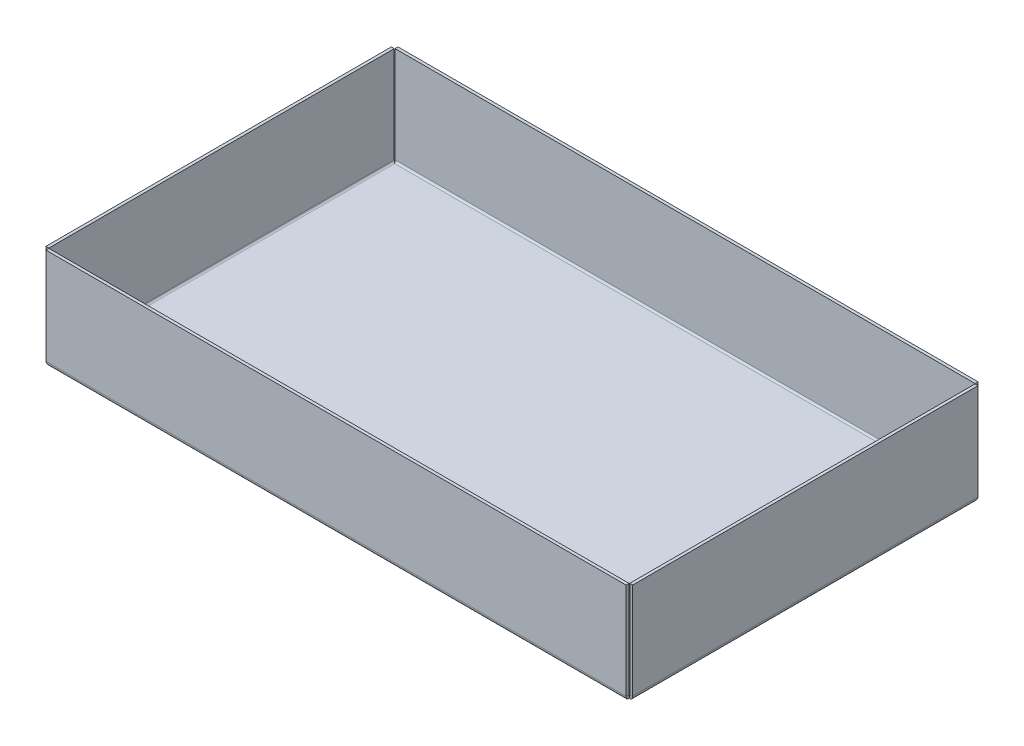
ISO-10303-21;
HEADER;
FILE_DESCRIPTION(('STEP AP214'),'2;1');
FILE_NAME('part.step','',(''),(''),'','','');
FILE_SCHEMA(('AUTOMOTIVE_DESIGN { 1 0 10303 214 1 1 1 1 }'));
ENDSEC;
DATA;
#1=APPLICATION_CONTEXT('core data for automotive mechanical design processes');
#2=APPLICATION_PROTOCOL_DEFINITION('international standard','automotive_design',2000,#1);
#3=PRODUCT_CONTEXT('',#1,'mechanical');
#4=PRODUCT('Part','Part','',(#3));
#5=PRODUCT_RELATED_PRODUCT_CATEGORY('part','',(#4));
#6=PRODUCT_DEFINITION_FORMATION('','',#4);
#7=PRODUCT_DEFINITION_CONTEXT('part definition',#1,'design');
#8=PRODUCT_DEFINITION('design','',#6,#7);
#9=PRODUCT_DEFINITION_SHAPE('','',#8);
#10=(LENGTH_UNIT() NAMED_UNIT(*) SI_UNIT(.MILLI.,.METRE.));
#11=(NAMED_UNIT(*) PLANE_ANGLE_UNIT() SI_UNIT($,.RADIAN.));
#12=(NAMED_UNIT(*) SI_UNIT($,.STERADIAN.) SOLID_ANGLE_UNIT());
#13=UNCERTAINTY_MEASURE_WITH_UNIT(LENGTH_MEASURE(1.E-05),#10,'distance_accuracy_value','');
#14=(GEOMETRIC_REPRESENTATION_CONTEXT(3) GLOBAL_UNCERTAINTY_ASSIGNED_CONTEXT((#13)) GLOBAL_UNIT_ASSIGNED_CONTEXT((#10,
#11,#12)) REPRESENTATION_CONTEXT('',''));
#15=CARTESIAN_POINT('',(0.,0.,0.));
#16=DIRECTION('',(0.,0.,1.));
#17=DIRECTION('',(1.,0.,0.));
#18=AXIS2_PLACEMENT_3D('',#15,#16,#17);
#19=CARTESIAN_POINT('',(-62.996335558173,0.,104.792769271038));
#20=DIRECTION('',(0.,1.,0.));
#21=DIRECTION('',(0.,0.,1.));
#22=AXIS2_PLACEMENT_3D('',#19,#20,#21);
#23=PLANE('',#22);
#24=DIRECTION('',(1.,0.,0.));
#25=VECTOR('',#24,1.);
#26=CARTESIAN_POINT('',(-62.996335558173,0.,-45.5752307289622));
#27=LINE('',#26,#25);
#28=CARTESIAN_POINT('',(-60.964335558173,0.,-45.5752307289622));
#29=VERTEX_POINT('',#28);
#30=CARTESIAN_POINT('',(188.971664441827,0.,-45.5752307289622));
#31=VERTEX_POINT('',#30);
#32=EDGE_CURVE('E52',#29,#31,#27,.T.);
#33=ORIENTED_EDGE('',*,*,#32,.T.);
#34=DIRECTION('',(0.,0.,1.));
#35=VECTOR('',#34,1.);
#36=CARTESIAN_POINT('',(188.971664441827,0.,-47.6072307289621));
#37=LINE('',#36,#35);
#38=CARTESIAN_POINT('',(188.971664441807,0.,102.760769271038));
#39=VERTEX_POINT('',#38);
#40=EDGE_CURVE('E207',#31,#39,#37,.T.);
#41=ORIENTED_EDGE('',*,*,#40,.T.);
#42=DIRECTION('',(-1.,0.,0.));
#43=VECTOR('',#42,1.);
#44=CARTESIAN_POINT('',(1461.00366444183,0.,102.760769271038));
#45=LINE('',#44,#43);
#46=CARTESIAN_POINT('',(-60.9643355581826,0.,102.760769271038));
#47=VERTEX_POINT('',#46);
#48=EDGE_CURVE('E319',#39,#47,#45,.T.);
#49=ORIENTED_EDGE('',*,*,#48,.T.);
#50=DIRECTION('',(0.,0.,-1.));
#51=VECTOR('',#50,1.);
#52=CARTESIAN_POINT('',(-60.964335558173,0.,104.792769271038));
#53=LINE('',#52,#51);
#54=EDGE_CURVE('E324',#47,#29,#53,.T.);
#55=ORIENTED_EDGE('',*,*,#54,.T.);
#56=EDGE_LOOP('',(#33,#41,#49,#55));
#57=FACE_BOUND('',#56,.T.);
#58=ADVANCED_FACE('F28',(#57),#23,.F.);
#59=CARTESIAN_POINT('',(-62.996335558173,1.27,104.792769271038));
#60=DIRECTION('',(0.,1.,0.));
#61=DIRECTION('',(0.,0.,1.));
#62=AXIS2_PLACEMENT_3D('',#59,#60,#61);
#63=PLANE('',#62);
#64=DIRECTION('',(0.,0.,1.));
#65=VECTOR('',#64,1.);
#66=CARTESIAN_POINT('',(188.971664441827,1.27,-47.6072307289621));
#67=LINE('',#66,#65);
#68=CARTESIAN_POINT('',(188.971664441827,1.27,-45.5752307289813));
#69=VERTEX_POINT('',#68);
#70=CARTESIAN_POINT('',(188.971664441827,1.27,102.760769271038));
#71=VERTEX_POINT('',#70);
#72=EDGE_CURVE('E191',#69,#71,#67,.T.);
#73=ORIENTED_EDGE('',*,*,#72,.F.);
#74=DIRECTION('',(1.,0.,0.));
#75=VECTOR('',#74,1.);
#76=CARTESIAN_POINT('',(-62.996335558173,1.27,-45.5752307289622));
#77=LINE('',#76,#75);
#78=CARTESIAN_POINT('',(-60.9643355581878,1.27,-45.5752307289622));
#79=VERTEX_POINT('',#78);
#80=EDGE_CURVE('E237',#79,#69,#77,.T.);
#81=ORIENTED_EDGE('',*,*,#80,.F.);
#82=DIRECTION('',(0.,0.,-1.));
#83=VECTOR('',#82,1.);
#84=CARTESIAN_POINT('',(-60.964335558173,1.27,104.792769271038));
#85=LINE('',#84,#83);
#86=CARTESIAN_POINT('',(-60.964335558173,1.27,102.760769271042));
#87=VERTEX_POINT('',#86);
#88=EDGE_CURVE('E288',#87,#79,#85,.T.);
#89=ORIENTED_EDGE('',*,*,#88,.F.);
#90=DIRECTION('',(-1.,0.,0.));
#91=VECTOR('',#90,1.);
#92=CARTESIAN_POINT('',(1461.00366444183,1.27,102.760769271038));
#93=LINE('',#92,#91);
#94=EDGE_CURVE('E345',#71,#87,#93,.T.);
#95=ORIENTED_EDGE('',*,*,#94,.F.);
#96=EDGE_LOOP('',(#73,#81,#89,#95));
#97=FACE_BOUND('',#96,.T.);
#98=ADVANCED_FACE('F30',(#97),#63,.T.);
#99=CARTESIAN_POINT('',(1461.00366444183,43.709903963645,104.792769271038));
#100=DIRECTION('',(0.,-1.,0.));
#101=DIRECTION('',(-1.,0.,0.));
#102=AXIS2_PLACEMENT_3D('',#99,#100,#101);
#103=PLANE('',#102);
#104=DIRECTION('',(0.,0.,-1.));
#105=VECTOR('',#104,1.);
#106=CARTESIAN_POINT('',(-61.5467304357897,43.709903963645,104.792769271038));
#107=LINE('',#106,#105);
#108=CARTESIAN_POINT('',(-61.5467304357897,43.709903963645,104.792769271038));
#109=VERTEX_POINT('',#108);
#110=CARTESIAN_POINT('',(-61.5467304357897,43.709903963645,103.522769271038));
#111=VERTEX_POINT('',#110);
#112=EDGE_CURVE('E11',#109,#111,#107,.T.);
#113=ORIENTED_EDGE('',*,*,#112,.F.);
#114=DIRECTION('',(-1.,0.,0.));
#115=VECTOR('',#114,1.);
#116=CARTESIAN_POINT('',(1461.00366444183,43.709903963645,104.792769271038));
#117=LINE('',#116,#115);
#118=CARTESIAN_POINT('',(189.554059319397,43.709903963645,104.792769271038));
#119=VERTEX_POINT('',#118);
#120=EDGE_CURVE('E353',#119,#109,#117,.T.);
#121=ORIENTED_EDGE('',*,*,#120,.F.);
#122=DIRECTION('',(0.,0.,-1.));
#123=VECTOR('',#122,1.);
#124=CARTESIAN_POINT('',(189.554059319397,43.709903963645,104.792769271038));
#125=LINE('',#124,#123);
#126=CARTESIAN_POINT('',(189.554059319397,43.709903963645,103.522769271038));
#127=VERTEX_POINT('',#126);
#128=EDGE_CURVE('E37',#119,#127,#125,.T.);
#129=ORIENTED_EDGE('',*,*,#128,.T.);
#130=DIRECTION('',(-1.,0.,0.));
#131=VECTOR('',#130,1.);
#132=CARTESIAN_POINT('',(1461.00366444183,43.709903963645,103.522769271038));
#133=LINE('',#132,#131);
#134=EDGE_CURVE('E367',#127,#111,#133,.T.);
#135=ORIENTED_EDGE('',*,*,#134,.T.);
#136=EDGE_LOOP('',(#113,#121,#129,#135));
#137=FACE_BOUND('',#136,.T.);
#138=ADVANCED_FACE('F383',(#137),#103,.F.);
#139=CARTESIAN_POINT('',(189.554059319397,43.709903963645,104.792769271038));
#140=DIRECTION('',(-1.,0.,0.));
#141=DIRECTION('',(0.,1.,0.));
#142=AXIS2_PLACEMENT_3D('',#139,#140,#141);
#143=PLANE('',#142);
#144=ORIENTED_EDGE('',*,*,#128,.F.);
#145=DIRECTION('',(0.,1.,0.));
#146=VECTOR('',#145,1.);
#147=CARTESIAN_POINT('',(189.554059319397,43.709903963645,104.792769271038));
#148=LINE('',#147,#146);
#149=CARTESIAN_POINT('',(189.554059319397,2.032,104.792769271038));
#150=VERTEX_POINT('',#149);
#151=EDGE_CURVE('E359',#119,#150,#148,.F.);
#152=ORIENTED_EDGE('',*,*,#151,.T.);
#153=DIRECTION('',(0.,0.,-1.));
#154=VECTOR('',#153,1.);
#155=CARTESIAN_POINT('',(189.554059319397,2.032,104.792769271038));
#156=LINE('',#155,#154);
#157=CARTESIAN_POINT('',(189.554059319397,2.032,103.522769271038));
#158=VERTEX_POINT('',#157);
#159=EDGE_CURVE('E378',#150,#158,#156,.T.);
#160=ORIENTED_EDGE('',*,*,#159,.T.);
#161=DIRECTION('',(0.,1.,0.));
#162=VECTOR('',#161,1.);
#163=CARTESIAN_POINT('',(189.554059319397,43.709903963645,103.522769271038));
#164=LINE('',#163,#162);
#165=EDGE_CURVE('E370',#127,#158,#164,.F.);
#166=ORIENTED_EDGE('',*,*,#165,.F.);
#167=EDGE_LOOP('',(#144,#152,#160,#166));
#168=FACE_BOUND('',#167,.T.);
#169=ADVANCED_FACE('F390',(#168),#143,.F.);
#170=CARTESIAN_POINT('',(-61.5467304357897,43.709903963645,104.792769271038));
#171=DIRECTION('',(-1.,0.,0.));
#172=DIRECTION('',(0.,1.,0.));
#173=AXIS2_PLACEMENT_3D('',#170,#171,#172);
#174=PLANE('',#173);
#175=DIRECTION('',(0.,1.,0.));
#176=VECTOR('',#175,1.);
#177=CARTESIAN_POINT('',(-61.5467304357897,43.709903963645,104.792769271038));
#178=LINE('',#177,#176);
#179=CARTESIAN_POINT('',(-61.5467304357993,2.032,104.792769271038));
#180=VERTEX_POINT('',#179);
#181=EDGE_CURVE('E362',#180,#109,#178,.T.);
#182=ORIENTED_EDGE('',*,*,#181,.T.);
#183=ORIENTED_EDGE('',*,*,#112,.T.);
#184=DIRECTION('',(0.,1.,0.));
#185=VECTOR('',#184,1.);
#186=CARTESIAN_POINT('',(-61.5467304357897,43.709903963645,103.522769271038));
#187=LINE('',#186,#185);
#188=CARTESIAN_POINT('',(-61.5467304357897,2.032,103.522769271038));
#189=VERTEX_POINT('',#188);
#190=EDGE_CURVE('E373',#189,#111,#187,.T.);
#191=ORIENTED_EDGE('',*,*,#190,.F.);
#192=DIRECTION('',(0.,0.,-1.));
#193=VECTOR('',#192,1.);
#194=CARTESIAN_POINT('',(-61.5467304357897,2.032,104.792769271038));
#195=LINE('',#194,#193);
#196=EDGE_CURVE('E32',#180,#189,#195,.T.);
#197=ORIENTED_EDGE('',*,*,#196,.F.);
#198=EDGE_LOOP('',(#182,#183,#191,#197));
#199=FACE_BOUND('',#198,.T.);
#200=ADVANCED_FACE('F447',(#199),#174,.T.);
#201=CARTESIAN_POINT('',(1461.00366444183,43.709903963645,103.522769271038));
#202=DIRECTION('',(0.,0.,-1.));
#203=DIRECTION('',(-1.,0.,0.));
#204=AXIS2_PLACEMENT_3D('',#201,#202,#203);
#205=PLANE('',#204);
#206=DIRECTION('',(-1.,0.,0.));
#207=VECTOR('',#206,1.);
#208=CARTESIAN_POINT('',(1461.00366444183,2.032,103.522769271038));
#209=LINE('',#208,#207);
#210=EDGE_CURVE('E368',#158,#189,#209,.T.);
#211=ORIENTED_EDGE('',*,*,#210,.T.);
#212=ORIENTED_EDGE('',*,*,#190,.T.);
#213=ORIENTED_EDGE('',*,*,#134,.F.);
#214=ORIENTED_EDGE('',*,*,#165,.T.);
#215=EDGE_LOOP('',(#211,#212,#213,#214));
#216=FACE_BOUND('',#215,.T.);
#217=ADVANCED_FACE('F388',(#216),#205,.T.);
#218=CARTESIAN_POINT('',(1461.00366444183,43.709903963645,104.792769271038));
#219=DIRECTION('',(0.,0.,-1.));
#220=DIRECTION('',(-1.,0.,0.));
#221=AXIS2_PLACEMENT_3D('',#218,#219,#220);
#222=PLANE('',#221);
#223=DIRECTION('',(-1.,0.,0.));
#224=VECTOR('',#223,1.);
#225=CARTESIAN_POINT('',(1461.00366444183,2.032,104.792769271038));
#226=LINE('',#225,#224);
#227=EDGE_CURVE('E356',#150,#180,#226,.T.);
#228=ORIENTED_EDGE('',*,*,#227,.F.);
#229=ORIENTED_EDGE('',*,*,#151,.F.);
#230=ORIENTED_EDGE('',*,*,#120,.T.);
#231=ORIENTED_EDGE('',*,*,#181,.F.);
#232=EDGE_LOOP('',(#228,#229,#230,#231));
#233=FACE_BOUND('',#232,.T.);
#234=ADVANCED_FACE('F451',(#233),#222,.F.);
#235=CARTESIAN_POINT('',(188.389269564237,2.032,101.998769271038));
#236=CARTESIAN_POINT('',(188.389269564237,2.032,101.575435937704));
#237=CARTESIAN_POINT('',(188.389269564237,2.032,101.152102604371));
#238=CARTESIAN_POINT('',(188.389269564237,2.032,100.728769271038));
#239=CARTESIAN_POINT('',(188.389269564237,3.556,101.998769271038));
#240=CARTESIAN_POINT('',(188.389269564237,4.40266666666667,101.575435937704));
#241=CARTESIAN_POINT('',(188.389269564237,5.24933333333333,101.152102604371));
#242=CARTESIAN_POINT('',(188.389269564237,6.096,100.728769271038));
#243=CARTESIAN_POINT('',(189.554059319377,3.556,103.522769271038));
#244=CARTESIAN_POINT('',(189.554059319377,4.40266666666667,103.946102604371));
#245=CARTESIAN_POINT('',(189.554059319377,5.24933333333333,104.369435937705));
#246=CARTESIAN_POINT('',(189.554059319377,6.096,104.792769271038));
#247=CARTESIAN_POINT('',(189.554059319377,2.032,103.522769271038));
#248=CARTESIAN_POINT('',(189.554059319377,2.032,103.946102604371));
#249=CARTESIAN_POINT('',(189.554059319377,2.032,104.369435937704));
#250=CARTESIAN_POINT('',(189.554059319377,2.032,104.792769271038));
#251=CARTESIAN_POINT('',(189.554059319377,0.507999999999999,103.522769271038));
#252=CARTESIAN_POINT('',(189.554059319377,-0.338666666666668,103.946102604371));
#253=CARTESIAN_POINT('',(189.554059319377,-1.18533333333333,104.369435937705));
#254=CARTESIAN_POINT('',(189.554059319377,-2.032,104.792769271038));
#255=CARTESIAN_POINT('',(188.389269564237,0.507999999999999,101.998769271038));
#256=CARTESIAN_POINT('',(188.389269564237,-0.338666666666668,101.575435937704));
#257=CARTESIAN_POINT('',(188.389269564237,-1.18533333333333,101.152102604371));
#258=CARTESIAN_POINT('',(188.389269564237,-2.032,100.728769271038));
#259=CARTESIAN_POINT('',(188.389269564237,2.032,101.998769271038));
#260=CARTESIAN_POINT('',(188.389269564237,2.032,101.575435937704));
#261=CARTESIAN_POINT('',(188.389269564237,2.032,101.152102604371));
#262=CARTESIAN_POINT('',(188.389269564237,2.032,100.728769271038));
#263=(BOUNDED_SURFACE() B_SPLINE_SURFACE(3,3,((#235,#236,#237,#238),(#239,#240,#241,#242),(#243,
#244,#245,#246),(#247,#248,#249,#250),(#251,#252,#253,#254),(#255,#256,#257,#258),(#259,#260,
#261,#262)),.UNSPECIFIED.,.T.,.F.,.F.) B_SPLINE_SURFACE_WITH_KNOTS((4,3,4),(4,4),(0.,0.5,1.),
(0.,1.),.UNSPECIFIED.) GEOMETRIC_REPRESENTATION_ITEM() RATIONAL_B_SPLINE_SURFACE(((1.,1.,1.,1.),
(0.333333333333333,0.333333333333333,0.333333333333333,0.333333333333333),(0.333333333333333,
0.333333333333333,0.333333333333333,0.333333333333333),(1.,1.,1.,1.),(0.333333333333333,
0.333333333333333,0.333333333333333,0.333333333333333),(0.333333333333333,0.333333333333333,
0.333333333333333,0.333333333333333),(1.,1.,1.,1.))) REPRESENTATION_ITEM('') SURFACE());
#264=CARTESIAN_POINT('',(188.971664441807,2.032,102.760769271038));
#265=DIRECTION('',(0.961295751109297,0.,-0.275518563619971));
#266=DIRECTION('',(-0.275518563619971,0.,-0.961295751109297));
#267=AXIS2_PLACEMENT_3D('',#264,#265,#266);
#268=ELLIPSE('',#267,2.11381356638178,2.032);
#269=EDGE_CURVE('E339',#150,#39,#268,.T.);
#270=DIRECTION('',(0.,1.,0.));
#271=VECTOR('',#270,1.);
#272=CARTESIAN_POINT('',(188.971664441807,0.,102.760769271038));
#273=LINE('',#272,#271);
#274=EDGE_CURVE('E206',#39,#71,#273,.T.);
#275=CARTESIAN_POINT('',(188.971664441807,2.032,102.760769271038));
#276=DIRECTION('',(0.794514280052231,0.,-0.607245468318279));
#277=DIRECTION('',(-0.607245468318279,0.,-0.794514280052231));
#278=AXIS2_PLACEMENT_3D('',#275,#276,#277);
#279=ELLIPSE('',#278,0.959076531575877,0.762);
#280=EDGE_CURVE('E44',#158,#71,#279,.T.);
#281=ORIENTED_EDGE('',*,*,#159,.F.);
#282=ORIENTED_EDGE('',*,*,#269,.T.);
#283=ORIENTED_EDGE('',*,*,#274,.T.);
#284=ORIENTED_EDGE('',*,*,#280,.F.);
#285=EDGE_LOOP('',(#281,#282,#283,#284));
#286=FACE_BOUND('',#285,.T.);
#287=ADVANCED_FACE('F394',(#286),#263,.F.);
#288=CARTESIAN_POINT('',(-61.5467304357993,2.032,103.522769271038));
#289=CARTESIAN_POINT('',(-61.5467304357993,2.032,103.946102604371));
#290=CARTESIAN_POINT('',(-61.5467304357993,2.032,104.369435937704));
#291=CARTESIAN_POINT('',(-61.5467304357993,2.032,104.792769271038));
#292=CARTESIAN_POINT('',(-61.5467304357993,3.556,103.522769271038));
#293=CARTESIAN_POINT('',(-61.5467304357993,4.40266666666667,103.946102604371));
#294=CARTESIAN_POINT('',(-61.5467304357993,5.24933333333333,104.369435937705));
#295=CARTESIAN_POINT('',(-61.5467304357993,6.096,104.792769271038));
#296=CARTESIAN_POINT('',(-60.3819406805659,3.556,101.998769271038));
#297=CARTESIAN_POINT('',(-60.3819406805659,4.40266666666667,101.575435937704));
#298=CARTESIAN_POINT('',(-60.3819406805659,5.24933333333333,101.152102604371));
#299=CARTESIAN_POINT('',(-60.3819406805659,6.096,100.728769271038));
#300=CARTESIAN_POINT('',(-60.3819406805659,2.032,101.998769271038));
#301=CARTESIAN_POINT('',(-60.3819406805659,2.032,101.575435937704));
#302=CARTESIAN_POINT('',(-60.3819406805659,2.032,101.152102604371));
#303=CARTESIAN_POINT('',(-60.3819406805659,2.032,100.728769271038));
#304=CARTESIAN_POINT('',(-60.3819406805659,0.508,101.998769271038));
#305=CARTESIAN_POINT('',(-60.3819406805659,-0.338666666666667,101.575435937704));
#306=CARTESIAN_POINT('',(-60.3819406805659,-1.18533333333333,101.152102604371));
#307=CARTESIAN_POINT('',(-60.3819406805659,-2.032,100.728769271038));
#308=CARTESIAN_POINT('',(-61.5467304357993,0.508,103.522769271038));
#309=CARTESIAN_POINT('',(-61.5467304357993,-0.338666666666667,103.946102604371));
#310=CARTESIAN_POINT('',(-61.5467304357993,-1.18533333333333,104.369435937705));
#311=CARTESIAN_POINT('',(-61.5467304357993,-2.032,104.792769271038));
#312=CARTESIAN_POINT('',(-61.5467304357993,2.032,103.522769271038));
#313=CARTESIAN_POINT('',(-61.5467304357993,2.032,103.946102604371));
#314=CARTESIAN_POINT('',(-61.5467304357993,2.032,104.369435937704));
#315=CARTESIAN_POINT('',(-61.5467304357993,2.032,104.792769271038));
#316=(BOUNDED_SURFACE() B_SPLINE_SURFACE(3,3,((#288,#289,#290,#291),(#292,#293,#294,#295),(#296,
#297,#298,#299),(#300,#301,#302,#303),(#304,#305,#306,#307),(#308,#309,#310,#311),(#312,#313,
#314,#315)),.UNSPECIFIED.,.T.,.F.,.F.) B_SPLINE_SURFACE_WITH_KNOTS((4,3,4),(4,4),(0.,0.5,1.),
(0.,1.),.UNSPECIFIED.) GEOMETRIC_REPRESENTATION_ITEM() RATIONAL_B_SPLINE_SURFACE(((1.,1.,1.,1.),
(0.333333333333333,0.333333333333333,0.333333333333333,0.333333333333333),(0.333333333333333,
0.333333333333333,0.333333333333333,0.333333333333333),(1.,1.,1.,1.),(0.333333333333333,
0.333333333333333,0.333333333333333,0.333333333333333),(0.333333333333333,0.333333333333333,
0.333333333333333,0.333333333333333),(1.,1.,1.,1.))) REPRESENTATION_ITEM('') SURFACE());
#317=CARTESIAN_POINT('',(-60.9643355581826,2.032,102.760769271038));
#318=DIRECTION('',(-0.961295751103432,0.,-0.275518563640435));
#319=DIRECTION('',(-0.275518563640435,0.,0.961295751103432));
#320=AXIS2_PLACEMENT_3D('',#317,#318,#319);
#321=ELLIPSE('',#320,2.11381356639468,2.032);
#322=EDGE_CURVE('E342',#47,#180,#321,.T.);
#323=CARTESIAN_POINT('',(-60.9643355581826,2.032,102.760769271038));
#324=DIRECTION('',(-0.794514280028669,0.,-0.607245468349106));
#325=DIRECTION('',(-0.607245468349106,0.,0.794514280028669));
#326=AXIS2_PLACEMENT_3D('',#323,#324,#325);
#327=ELLIPSE('',#326,0.959076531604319,0.762);
#328=EDGE_CURVE('E348',#87,#189,#327,.T.);
#329=DIRECTION('',(0.,1.,0.));
#330=VECTOR('',#329,1.);
#331=CARTESIAN_POINT('',(-60.9643355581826,0.,102.760769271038));
#332=LINE('',#331,#330);
#333=EDGE_CURVE('E351',#47,#87,#332,.T.);
#334=ORIENTED_EDGE('',*,*,#322,.T.);
#335=ORIENTED_EDGE('',*,*,#196,.T.);
#336=ORIENTED_EDGE('',*,*,#328,.F.);
#337=ORIENTED_EDGE('',*,*,#333,.F.);
#338=EDGE_LOOP('',(#334,#335,#336,#337));
#339=FACE_BOUND('',#338,.T.);
#340=ADVANCED_FACE('F439',(#339),#316,.F.);
#341=CARTESIAN_POINT('',(1461.00366444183,2.032,102.760769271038));
#342=DIRECTION('',(-1.,0.,0.));
#343=DIRECTION('',(0.,0.,1.));
#344=AXIS2_PLACEMENT_3D('',#341,#342,#343);
#345=CYLINDRICAL_SURFACE('',#344,0.762);
#346=ORIENTED_EDGE('',*,*,#94,.T.);
#347=ORIENTED_EDGE('',*,*,#328,.T.);
#348=ORIENTED_EDGE('',*,*,#210,.F.);
#349=ORIENTED_EDGE('',*,*,#280,.T.);
#350=EDGE_LOOP('',(#346,#347,#348,#349));
#351=FACE_BOUND('',#350,.T.);
#352=ADVANCED_FACE('F437',(#351),#345,.F.);
#353=CARTESIAN_POINT('',(1461.00366444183,2.032,102.760769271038));
#354=DIRECTION('',(-1.,0.,0.));
#355=DIRECTION('',(0.,0.,1.));
#356=AXIS2_PLACEMENT_3D('',#353,#354,#355);
#357=CYLINDRICAL_SURFACE('',#356,2.032);
#358=ORIENTED_EDGE('',*,*,#48,.F.);
#359=ORIENTED_EDGE('',*,*,#269,.F.);
#360=ORIENTED_EDGE('',*,*,#227,.T.);
#361=ORIENTED_EDGE('',*,*,#322,.F.);
#362=EDGE_LOOP('',(#358,#359,#360,#361));
#363=FACE_BOUND('',#362,.T.);
#364=ADVANCED_FACE('F396',(#363),#357,.T.);
#365=CARTESIAN_POINT('',(-62.996335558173,43.709903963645,1374.79276927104));
#366=DIRECTION('',(0.,-1.,0.));
#367=DIRECTION('',(0.,0.,-1.));
#368=AXIS2_PLACEMENT_3D('',#365,#366,#367);
#369=PLANE('',#368);
#370=DIRECTION('',(1.,0.,0.));
#371=VECTOR('',#370,1.);
#372=CARTESIAN_POINT('',(-62.9963355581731,43.709903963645,-46.1576256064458));
#373=LINE('',#372,#371);
#374=CARTESIAN_POINT('',(-62.9963355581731,43.709903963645,-46.1576256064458));
#375=VERTEX_POINT('',#374);
#376=CARTESIAN_POINT('',(-61.7263355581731,43.709903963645,-46.1576256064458));
#377=VERTEX_POINT('',#376);
#378=EDGE_CURVE('E290',#375,#377,#373,.T.);
#379=ORIENTED_EDGE('',*,*,#378,.F.);
#380=DIRECTION('',(0.,0.,-1.));
#381=VECTOR('',#380,1.);
#382=CARTESIAN_POINT('',(-62.996335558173,43.709903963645,1374.79276927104));
#383=LINE('',#382,#381);
#384=CARTESIAN_POINT('',(-62.9963355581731,43.709903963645,103.343164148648));
#385=VERTEX_POINT('',#384);
#386=EDGE_CURVE('E307',#385,#375,#383,.T.);
#387=ORIENTED_EDGE('',*,*,#386,.F.);
#388=DIRECTION('',(1.,0.,0.));
#389=VECTOR('',#388,1.);
#390=CARTESIAN_POINT('',(-62.9963355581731,43.709903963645,103.343164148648));
#391=LINE('',#390,#389);
#392=CARTESIAN_POINT('',(-61.7263355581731,43.709903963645,103.343164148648));
#393=VERTEX_POINT('',#392);
#394=EDGE_CURVE('E268',#385,#393,#391,.T.);
#395=ORIENTED_EDGE('',*,*,#394,.T.);
#396=DIRECTION('',(0.,0.,-1.));
#397=VECTOR('',#396,1.);
#398=CARTESIAN_POINT('',(-61.726335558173,43.709903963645,1374.79276927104));
#399=LINE('',#398,#397);
#400=EDGE_CURVE('E295',#393,#377,#399,.T.);
#401=ORIENTED_EDGE('',*,*,#400,.T.);
#402=EDGE_LOOP('',(#379,#387,#395,#401));
#403=FACE_BOUND('',#402,.T.);
#404=ADVANCED_FACE('F429',(#403),#369,.F.);
#405=CARTESIAN_POINT('',(-62.9963355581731,43.709903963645,103.343164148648));
#406=DIRECTION('',(0.,0.,-1.));
#407=DIRECTION('',(0.,1.,0.));
#408=AXIS2_PLACEMENT_3D('',#405,#406,#407);
#409=PLANE('',#408);
#410=ORIENTED_EDGE('',*,*,#394,.F.);
#411=DIRECTION('',(0.,1.,0.));
#412=VECTOR('',#411,1.);
#413=CARTESIAN_POINT('',(-62.9963355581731,43.709903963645,103.343164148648));
#414=LINE('',#413,#412);
#415=CARTESIAN_POINT('',(-62.9963355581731,2.032,103.343164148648));
#416=VERTEX_POINT('',#415);
#417=EDGE_CURVE('E298',#385,#416,#414,.F.);
#418=ORIENTED_EDGE('',*,*,#417,.T.);
#419=DIRECTION('',(1.,0.,0.));
#420=VECTOR('',#419,1.);
#421=CARTESIAN_POINT('',(-62.9963355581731,2.032,103.343164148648));
#422=LINE('',#421,#420);
#423=CARTESIAN_POINT('',(-61.7263355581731,2.032,103.343164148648));
#424=VERTEX_POINT('',#423);
#425=EDGE_CURVE('E296',#416,#424,#422,.T.);
#426=ORIENTED_EDGE('',*,*,#425,.T.);
#427=DIRECTION('',(0.,1.,0.));
#428=VECTOR('',#427,1.);
#429=CARTESIAN_POINT('',(-61.7263355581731,43.709903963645,103.343164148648));
#430=LINE('',#429,#428);
#431=EDGE_CURVE('E302',#393,#424,#430,.F.);
#432=ORIENTED_EDGE('',*,*,#431,.F.);
#433=EDGE_LOOP('',(#410,#418,#426,#432));
#434=FACE_BOUND('',#433,.T.);
#435=ADVANCED_FACE('F410',(#434),#409,.F.);
#436=CARTESIAN_POINT('',(-62.9963355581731,43.709903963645,-46.1576256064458));
#437=DIRECTION('',(0.,0.,-1.));
#438=DIRECTION('',(0.,1.,0.));
#439=AXIS2_PLACEMENT_3D('',#436,#437,#438);
#440=PLANE('',#439);
#441=DIRECTION('',(0.,1.,0.));
#442=VECTOR('',#441,1.);
#443=CARTESIAN_POINT('',(-62.9963355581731,43.709903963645,-46.1576256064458));
#444=LINE('',#443,#442);
#445=CARTESIAN_POINT('',(-62.996335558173,2.032,-46.1576256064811));
#446=VERTEX_POINT('',#445);
#447=EDGE_CURVE('E293',#446,#375,#444,.T.);
#448=ORIENTED_EDGE('',*,*,#447,.T.);
#449=ORIENTED_EDGE('',*,*,#378,.T.);
#450=DIRECTION('',(0.,1.,0.));
#451=VECTOR('',#450,1.);
#452=CARTESIAN_POINT('',(-61.7263355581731,43.709903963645,-46.1576256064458));
#453=LINE('',#452,#451);
#454=CARTESIAN_POINT('',(-61.7263355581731,2.032,-46.1576256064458));
#455=VERTEX_POINT('',#454);
#456=EDGE_CURVE('E299',#455,#377,#453,.T.);
#457=ORIENTED_EDGE('',*,*,#456,.F.);
#458=DIRECTION('',(1.,0.,0.));
#459=VECTOR('',#458,1.);
#460=CARTESIAN_POINT('',(-62.9963355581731,2.032,-46.1576256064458));
#461=LINE('',#460,#459);
#462=EDGE_CURVE('E285',#446,#455,#461,.T.);
#463=ORIENTED_EDGE('',*,*,#462,.F.);
#464=EDGE_LOOP('',(#448,#449,#457,#463));
#465=FACE_BOUND('',#464,.T.);
#466=ADVANCED_FACE('F424',(#465),#440,.T.);
#467=CARTESIAN_POINT('',(-61.726335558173,43.709903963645,1374.79276927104));
#468=DIRECTION('',(1.,0.,0.));
#469=DIRECTION('',(0.,0.,-1.));
#470=AXIS2_PLACEMENT_3D('',#467,#468,#469);
#471=PLANE('',#470);
#472=DIRECTION('',(0.,0.,-1.));
#473=VECTOR('',#472,1.);
#474=CARTESIAN_POINT('',(-61.726335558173,2.032,1374.79276927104));
#475=LINE('',#474,#473);
#476=EDGE_CURVE('E292',#424,#455,#475,.T.);
#477=ORIENTED_EDGE('',*,*,#476,.T.);
#478=ORIENTED_EDGE('',*,*,#456,.T.);
#479=ORIENTED_EDGE('',*,*,#400,.F.);
#480=ORIENTED_EDGE('',*,*,#431,.T.);
#481=EDGE_LOOP('',(#477,#478,#479,#480));
#482=FACE_BOUND('',#481,.T.);
#483=ADVANCED_FACE('F415',(#482),#471,.T.);
#484=CARTESIAN_POINT('',(-62.996335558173,43.709903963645,1374.79276927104));
#485=DIRECTION('',(1.,0.,0.));
#486=DIRECTION('',(0.,0.,-1.));
#487=AXIS2_PLACEMENT_3D('',#484,#485,#486);
#488=PLANE('',#487);
#489=DIRECTION('',(0.,0.,-1.));
#490=VECTOR('',#489,1.);
#491=CARTESIAN_POINT('',(-62.996335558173,2.032,1374.79276927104));
#492=LINE('',#491,#490);
#493=EDGE_CURVE('E316',#416,#446,#492,.T.);
#494=ORIENTED_EDGE('',*,*,#493,.F.);
#495=ORIENTED_EDGE('',*,*,#417,.F.);
#496=ORIENTED_EDGE('',*,*,#386,.T.);
#497=ORIENTED_EDGE('',*,*,#447,.F.);
#498=EDGE_LOOP('',(#494,#495,#496,#497));
#499=FACE_BOUND('',#498,.T.);
#500=ADVANCED_FACE('F426',(#499),#488,.F.);
#501=CARTESIAN_POINT('',(-60.202335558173,2.032,102.178374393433));
#502=CARTESIAN_POINT('',(-59.7790022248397,2.032,102.178374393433));
#503=CARTESIAN_POINT('',(-59.3556688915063,2.032,102.178374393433));
#504=CARTESIAN_POINT('',(-58.932335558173,2.032,102.178374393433));
#505=CARTESIAN_POINT('',(-60.202335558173,3.556,102.178374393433));
#506=CARTESIAN_POINT('',(-59.7790022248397,4.40266666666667,102.178374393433));
#507=CARTESIAN_POINT('',(-59.3556688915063,5.24933333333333,102.178374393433));
#508=CARTESIAN_POINT('',(-58.932335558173,6.096,102.178374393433));
#509=CARTESIAN_POINT('',(-61.726335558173,3.556,103.343164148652));
#510=CARTESIAN_POINT('',(-62.1496688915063,4.40266666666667,103.343164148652));
#511=CARTESIAN_POINT('',(-62.5730022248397,5.24933333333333,103.343164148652));
#512=CARTESIAN_POINT('',(-62.996335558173,6.096,103.343164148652));
#513=CARTESIAN_POINT('',(-61.726335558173,2.032,103.343164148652));
#514=CARTESIAN_POINT('',(-62.1496688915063,2.032,103.343164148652));
#515=CARTESIAN_POINT('',(-62.5730022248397,2.032,103.343164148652));
#516=CARTESIAN_POINT('',(-62.996335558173,2.032,103.343164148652));
#517=CARTESIAN_POINT('',(-61.726335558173,0.508,103.343164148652));
#518=CARTESIAN_POINT('',(-62.1496688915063,-0.338666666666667,103.343164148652));
#519=CARTESIAN_POINT('',(-62.5730022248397,-1.18533333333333,103.343164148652));
#520=CARTESIAN_POINT('',(-62.996335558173,-2.032,103.343164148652));
#521=CARTESIAN_POINT('',(-60.202335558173,0.508,102.178374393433));
#522=CARTESIAN_POINT('',(-59.7790022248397,-0.338666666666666,102.178374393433));
#523=CARTESIAN_POINT('',(-59.3556688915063,-1.18533333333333,102.178374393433));
#524=CARTESIAN_POINT('',(-58.932335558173,-2.032,102.178374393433));
#525=CARTESIAN_POINT('',(-60.202335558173,2.032,102.178374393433));
#526=CARTESIAN_POINT('',(-59.7790022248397,2.032,102.178374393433));
#527=CARTESIAN_POINT('',(-59.3556688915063,2.032,102.178374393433));
#528=CARTESIAN_POINT('',(-58.932335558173,2.032,102.178374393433));
#529=(BOUNDED_SURFACE() B_SPLINE_SURFACE(3,3,((#501,#502,#503,#504),(#505,#506,#507,#508),(#509,
#510,#511,#512),(#513,#514,#515,#516),(#517,#518,#519,#520),(#521,#522,#523,#524),(#525,#526,
#527,#528)),.UNSPECIFIED.,.T.,.F.,.F.) B_SPLINE_SURFACE_WITH_KNOTS((4,3,4),(4,4),(0.,0.5,1.),
(0.,1.),.UNSPECIFIED.) GEOMETRIC_REPRESENTATION_ITEM() RATIONAL_B_SPLINE_SURFACE(((1.,1.,1.,1.),
(0.333333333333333,0.333333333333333,0.333333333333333,0.333333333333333),(0.333333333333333,
0.333333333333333,0.333333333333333,0.333333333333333),(1.,1.,1.,1.),(0.333333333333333,
0.333333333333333,0.333333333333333,0.333333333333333),(0.333333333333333,0.333333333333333,
0.333333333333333,0.333333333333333),(1.,1.,1.,1.))) REPRESENTATION_ITEM('') SURFACE());
#530=CARTESIAN_POINT('',(-60.964335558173,2.032,102.760769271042));
#531=DIRECTION('',(0.275518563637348,0.,0.961295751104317));
#532=DIRECTION('',(0.961295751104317,0.,-0.275518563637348));
#533=AXIS2_PLACEMENT_3D('',#530,#531,#532);
#534=ELLIPSE('',#533,2.11381356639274,2.032);
#535=EDGE_CURVE('E313',#416,#47,#534,.T.);
#536=CARTESIAN_POINT('',(-60.964335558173,2.032,102.760769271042));
#537=DIRECTION('',(0.607245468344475,0.,0.794514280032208));
#538=DIRECTION('',(0.794514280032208,0.,-0.607245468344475));
#539=AXIS2_PLACEMENT_3D('',#536,#537,#538);
#540=ELLIPSE('',#539,0.959076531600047,0.762);
#541=EDGE_CURVE('E320',#424,#87,#540,.T.);
#542=ORIENTED_EDGE('',*,*,#425,.F.);
#543=ORIENTED_EDGE('',*,*,#535,.T.);
#544=ORIENTED_EDGE('',*,*,#333,.T.);
#545=ORIENTED_EDGE('',*,*,#541,.F.);
#546=EDGE_LOOP('',(#542,#543,#544,#545));
#547=FACE_BOUND('',#546,.T.);
#548=ADVANCED_FACE('F406',(#547),#529,.F.);
#549=CARTESIAN_POINT('',(-61.726335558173,2.032,-46.1576256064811));
#550=CARTESIAN_POINT('',(-62.1496688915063,2.032,-46.1576256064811));
#551=CARTESIAN_POINT('',(-62.5730022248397,2.032,-46.1576256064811));
#552=CARTESIAN_POINT('',(-62.996335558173,2.032,-46.1576256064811));
#553=CARTESIAN_POINT('',(-61.726335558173,3.556,-46.1576256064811));
#554=CARTESIAN_POINT('',(-62.1496688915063,4.40266666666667,-46.1576256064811));
#555=CARTESIAN_POINT('',(-62.5730022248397,5.24933333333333,-46.1576256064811));
#556=CARTESIAN_POINT('',(-62.996335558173,6.096,-46.1576256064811));
#557=CARTESIAN_POINT('',(-60.202335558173,3.556,-44.992835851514));
#558=CARTESIAN_POINT('',(-59.7790022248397,4.40266666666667,-44.992835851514));
#559=CARTESIAN_POINT('',(-59.3556688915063,5.24933333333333,-44.992835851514));
#560=CARTESIAN_POINT('',(-58.932335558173,6.096,-44.992835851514));
#561=CARTESIAN_POINT('',(-60.202335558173,2.032,-44.992835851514));
#562=CARTESIAN_POINT('',(-59.7790022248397,2.032,-44.992835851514));
#563=CARTESIAN_POINT('',(-59.3556688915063,2.032,-44.992835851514));
#564=CARTESIAN_POINT('',(-58.932335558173,2.032,-44.992835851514));
#565=CARTESIAN_POINT('',(-60.202335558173,0.508,-44.992835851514));
#566=CARTESIAN_POINT('',(-59.7790022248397,-0.338666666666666,-44.992835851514));
#567=CARTESIAN_POINT('',(-59.3556688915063,-1.18533333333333,-44.992835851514));
#568=CARTESIAN_POINT('',(-58.932335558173,-2.032,-44.992835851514));
#569=CARTESIAN_POINT('',(-61.726335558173,0.507999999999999,-46.1576256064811));
#570=CARTESIAN_POINT('',(-62.1496688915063,-0.338666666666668,-46.1576256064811));
#571=CARTESIAN_POINT('',(-62.5730022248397,-1.18533333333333,-46.1576256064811));
#572=CARTESIAN_POINT('',(-62.996335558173,-2.032,-46.1576256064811));
#573=CARTESIAN_POINT('',(-61.726335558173,2.032,-46.1576256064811));
#574=CARTESIAN_POINT('',(-62.1496688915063,2.032,-46.1576256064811));
#575=CARTESIAN_POINT('',(-62.5730022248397,2.032,-46.1576256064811));
#576=CARTESIAN_POINT('',(-62.996335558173,2.032,-46.1576256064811));
#577=(BOUNDED_SURFACE() B_SPLINE_SURFACE(3,3,((#549,#550,#551,#552),(#553,#554,#555,#556),(#557,
#558,#559,#560),(#561,#562,#563,#564),(#565,#566,#567,#568),(#569,#570,#571,#572),(#573,#574,
#575,#576)),.UNSPECIFIED.,.T.,.F.,.F.) B_SPLINE_SURFACE_WITH_KNOTS((4,3,4),(4,4),(0.,0.5,1.),
(0.,1.),.UNSPECIFIED.) GEOMETRIC_REPRESENTATION_ITEM() RATIONAL_B_SPLINE_SURFACE(((1.,1.,1.,1.),
(0.333333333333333,0.333333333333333,0.333333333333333,0.333333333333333),(0.333333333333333,
0.333333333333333,0.333333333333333,0.333333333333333),(1.,1.,1.,1.),(0.333333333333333,
0.333333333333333,0.333333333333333,0.333333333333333),(0.333333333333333,0.333333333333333,
0.333333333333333,0.333333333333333),(1.,1.,1.,1.))) REPRESENTATION_ITEM('') SURFACE());
#578=CARTESIAN_POINT('',(-60.964335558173,2.032,-45.5752307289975));
#579=DIRECTION('',(0.275518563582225,0.,-0.961295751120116));
#580=DIRECTION('',(-0.961295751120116,0.,-0.275518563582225));
#581=AXIS2_PLACEMENT_3D('',#578,#579,#580);
#582=ELLIPSE('',#581,2.113813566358,2.032);
#583=EDGE_CURVE('E289',#29,#446,#582,.T.);
#584=CARTESIAN_POINT('',(-60.964335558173,2.032,-45.5752307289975));
#585=DIRECTION('',(0.607245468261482,0.,-0.79451428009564));
#586=DIRECTION('',(-0.79451428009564,0.,-0.607245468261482));
#587=AXIS2_PLACEMENT_3D('',#584,#585,#586);
#588=ELLIPSE('',#587,0.959076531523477,0.762);
#589=EDGE_CURVE('E325',#79,#455,#588,.T.);
#590=DIRECTION('',(0.,1.,0.));
#591=VECTOR('',#590,1.);
#592=CARTESIAN_POINT('',(-60.964335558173,0.,-45.5752307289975));
#593=LINE('',#592,#591);
#594=EDGE_CURVE('E321',#29,#79,#593,.T.);
#595=ORIENTED_EDGE('',*,*,#583,.T.);
#596=ORIENTED_EDGE('',*,*,#462,.T.);
#597=ORIENTED_EDGE('',*,*,#589,.F.);
#598=ORIENTED_EDGE('',*,*,#594,.F.);
#599=EDGE_LOOP('',(#595,#596,#597,#598));
#600=FACE_BOUND('',#599,.T.);
#601=ADVANCED_FACE('F421',(#600),#577,.F.);
#602=CARTESIAN_POINT('',(-60.964335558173,2.032,104.792769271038));
#603=DIRECTION('',(0.,0.,-1.));
#604=DIRECTION('',(-1.,0.,0.));
#605=AXIS2_PLACEMENT_3D('',#602,#603,#604);
#606=CYLINDRICAL_SURFACE('',#605,0.762);
#607=ORIENTED_EDGE('',*,*,#88,.T.);
#608=ORIENTED_EDGE('',*,*,#589,.T.);
#609=ORIENTED_EDGE('',*,*,#476,.F.);
#610=ORIENTED_EDGE('',*,*,#541,.T.);
#611=EDGE_LOOP('',(#607,#608,#609,#610));
#612=FACE_BOUND('',#611,.T.);
#613=ADVANCED_FACE('F418',(#612),#606,.F.);
#614=CARTESIAN_POINT('',(-60.964335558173,2.032,104.792769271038));
#615=DIRECTION('',(0.,0.,-1.));
#616=DIRECTION('',(-1.,0.,0.));
#617=AXIS2_PLACEMENT_3D('',#614,#615,#616);
#618=CYLINDRICAL_SURFACE('',#617,2.032);
#619=ORIENTED_EDGE('',*,*,#54,.F.);
#620=ORIENTED_EDGE('',*,*,#535,.F.);
#621=ORIENTED_EDGE('',*,*,#493,.T.);
#622=ORIENTED_EDGE('',*,*,#583,.F.);
#623=EDGE_LOOP('',(#619,#620,#621,#622));
#624=FACE_BOUND('',#623,.T.);
#625=ADVANCED_FACE('F403',(#624),#618,.T.);
#626=CARTESIAN_POINT('',(-1332.99633555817,43.709903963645,-47.6072307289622));
#627=DIRECTION('',(0.,-1.,0.));
#628=DIRECTION('',(1.,0.,0.));
#629=AXIS2_PLACEMENT_3D('',#626,#627,#628);
#630=PLANE('',#629);
#631=DIRECTION('',(0.,0.,1.));
#632=VECTOR('',#631,1.);
#633=CARTESIAN_POINT('',(189.554059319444,43.709903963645,-47.6072307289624));
#634=LINE('',#633,#632);
#635=CARTESIAN_POINT('',(189.554059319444,43.709903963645,-47.6072307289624));
#636=VERTEX_POINT('',#635);
#637=CARTESIAN_POINT('',(189.554059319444,43.709903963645,-46.3372307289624));
#638=VERTEX_POINT('',#637);
#639=EDGE_CURVE('E239',#636,#638,#634,.T.);
#640=ORIENTED_EDGE('',*,*,#639,.F.);
#641=DIRECTION('',(1.,0.,0.));
#642=VECTOR('',#641,1.);
#643=CARTESIAN_POINT('',(-1332.99633555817,43.709903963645,-47.6072307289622));
#644=LINE('',#643,#642);
#645=CARTESIAN_POINT('',(-61.5467304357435,43.709903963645,-47.6072307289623));
#646=VERTEX_POINT('',#645);
#647=EDGE_CURVE('E256',#646,#636,#644,.T.);
#648=ORIENTED_EDGE('',*,*,#647,.F.);
#649=DIRECTION('',(0.,0.,1.));
#650=VECTOR('',#649,1.);
#651=CARTESIAN_POINT('',(-61.5467304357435,43.709903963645,-47.6072307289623));
#652=LINE('',#651,#650);
#653=CARTESIAN_POINT('',(-61.5467304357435,43.709903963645,-46.3372307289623));
#654=VERTEX_POINT('',#653);
#655=EDGE_CURVE('E201',#646,#654,#652,.T.);
#656=ORIENTED_EDGE('',*,*,#655,.T.);
#657=DIRECTION('',(1.,0.,0.));
#658=VECTOR('',#657,1.);
#659=CARTESIAN_POINT('',(-1332.99633555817,43.709903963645,-46.3372307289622));
#660=LINE('',#659,#658);
#661=EDGE_CURVE('E244',#654,#638,#660,.T.);
#662=ORIENTED_EDGE('',*,*,#661,.T.);
#663=EDGE_LOOP('',(#640,#648,#656,#662));
#664=FACE_BOUND('',#663,.T.);
#665=ADVANCED_FACE('F484',(#664),#630,.F.);
#666=CARTESIAN_POINT('',(-61.5467304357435,43.709903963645,-47.6072307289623));
#667=DIRECTION('',(1.,0.,0.));
#668=DIRECTION('',(0.,1.,0.));
#669=AXIS2_PLACEMENT_3D('',#666,#667,#668);
#670=PLANE('',#669);
#671=ORIENTED_EDGE('',*,*,#655,.F.);
#672=DIRECTION('',(0.,1.,0.));
#673=VECTOR('',#672,1.);
#674=CARTESIAN_POINT('',(-61.5467304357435,43.709903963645,-47.6072307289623));
#675=LINE('',#674,#673);
#676=CARTESIAN_POINT('',(-61.5467304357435,2.032,-47.6072307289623));
#677=VERTEX_POINT('',#676);
#678=EDGE_CURVE('E247',#646,#677,#675,.F.);
#679=ORIENTED_EDGE('',*,*,#678,.T.);
#680=DIRECTION('',(0.,0.,1.));
#681=VECTOR('',#680,1.);
#682=CARTESIAN_POINT('',(-61.5467304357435,2.032,-47.6072307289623));
#683=LINE('',#682,#681);
#684=CARTESIAN_POINT('',(-61.5467304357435,2.032,-46.3372307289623));
#685=VERTEX_POINT('',#684);
#686=EDGE_CURVE('E245',#677,#685,#683,.T.);
#687=ORIENTED_EDGE('',*,*,#686,.T.);
#688=DIRECTION('',(0.,1.,0.));
#689=VECTOR('',#688,1.);
#690=CARTESIAN_POINT('',(-61.5467304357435,43.709903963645,-46.3372307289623));
#691=LINE('',#690,#689);
#692=EDGE_CURVE('E251',#654,#685,#691,.F.);
#693=ORIENTED_EDGE('',*,*,#692,.F.);
#694=EDGE_LOOP('',(#671,#679,#687,#693));
#695=FACE_BOUND('',#694,.T.);
#696=ADVANCED_FACE('F554',(#695),#670,.F.);
#697=CARTESIAN_POINT('',(189.554059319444,43.709903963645,-47.6072307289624));
#698=DIRECTION('',(1.,0.,0.));
#699=DIRECTION('',(0.,1.,0.));
#700=AXIS2_PLACEMENT_3D('',#697,#698,#699);
#701=PLANE('',#700);
#702=DIRECTION('',(0.,1.,0.));
#703=VECTOR('',#702,1.);
#704=CARTESIAN_POINT('',(189.554059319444,43.709903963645,-47.6072307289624));
#705=LINE('',#704,#703);
#706=CARTESIAN_POINT('',(189.554059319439,2.032,-47.6072307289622));
#707=VERTEX_POINT('',#706);
#708=EDGE_CURVE('E242',#707,#636,#705,.T.);
#709=ORIENTED_EDGE('',*,*,#708,.T.);
#710=ORIENTED_EDGE('',*,*,#639,.T.);
#711=DIRECTION('',(0.,1.,0.));
#712=VECTOR('',#711,1.);
#713=CARTESIAN_POINT('',(189.554059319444,43.709903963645,-46.3372307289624));
#714=LINE('',#713,#712);
#715=CARTESIAN_POINT('',(189.554059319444,2.032,-46.3372307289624));
#716=VERTEX_POINT('',#715);
#717=EDGE_CURVE('E248',#716,#638,#714,.T.);
#718=ORIENTED_EDGE('',*,*,#717,.F.);
#719=DIRECTION('',(0.,0.,1.));
#720=VECTOR('',#719,1.);
#721=CARTESIAN_POINT('',(189.554059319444,2.032,-47.6072307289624));
#722=LINE('',#721,#720);
#723=EDGE_CURVE('E234',#707,#716,#722,.T.);
#724=ORIENTED_EDGE('',*,*,#723,.F.);
#725=EDGE_LOOP('',(#709,#710,#718,#724));
#726=FACE_BOUND('',#725,.T.);
#727=ADVANCED_FACE('F550',(#726),#701,.T.);
#728=CARTESIAN_POINT('',(-1332.99633555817,43.709903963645,-46.3372307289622));
#729=DIRECTION('',(0.,0.,1.));
#730=DIRECTION('',(1.,0.,0.));
#731=AXIS2_PLACEMENT_3D('',#728,#729,#730);
#732=PLANE('',#731);
#733=DIRECTION('',(1.,0.,0.));
#734=VECTOR('',#733,1.);
#735=CARTESIAN_POINT('',(-1332.99633555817,2.032,-46.3372307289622));
#736=LINE('',#735,#734);
#737=EDGE_CURVE('E241',#685,#716,#736,.T.);
#738=ORIENTED_EDGE('',*,*,#737,.T.);
#739=ORIENTED_EDGE('',*,*,#717,.T.);
#740=ORIENTED_EDGE('',*,*,#661,.F.);
#741=ORIENTED_EDGE('',*,*,#692,.T.);
#742=EDGE_LOOP('',(#738,#739,#740,#741));
#743=FACE_BOUND('',#742,.T.);
#744=ADVANCED_FACE('F548',(#743),#732,.T.);
#745=CARTESIAN_POINT('',(-1332.99633555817,43.709903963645,-47.6072307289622));
#746=DIRECTION('',(0.,0.,1.));
#747=DIRECTION('',(1.,0.,0.));
#748=AXIS2_PLACEMENT_3D('',#745,#746,#747);
#749=PLANE('',#748);
#750=DIRECTION('',(1.,0.,0.));
#751=VECTOR('',#750,1.);
#752=CARTESIAN_POINT('',(-1332.99633555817,2.032,-47.6072307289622));
#753=LINE('',#752,#751);
#754=EDGE_CURVE('E265',#677,#707,#753,.T.);
#755=ORIENTED_EDGE('',*,*,#754,.F.);
#756=ORIENTED_EDGE('',*,*,#678,.F.);
#757=ORIENTED_EDGE('',*,*,#647,.T.);
#758=ORIENTED_EDGE('',*,*,#708,.F.);
#759=EDGE_LOOP('',(#755,#756,#757,#758));
#760=FACE_BOUND('',#759,.T.);
#761=ADVANCED_FACE('F529',(#760),#749,.F.);
#762=CARTESIAN_POINT('',(-60.3819406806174,2.032,-44.8132307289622));
#763=CARTESIAN_POINT('',(-60.3819406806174,2.032,-44.3898973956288));
#764=CARTESIAN_POINT('',(-60.3819406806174,2.032,-43.9665640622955));
#765=CARTESIAN_POINT('',(-60.3819406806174,2.032,-43.5432307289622));
#766=CARTESIAN_POINT('',(-60.3819406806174,3.556,-44.8132307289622));
#767=CARTESIAN_POINT('',(-60.3819406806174,4.40266666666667,-44.3898973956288));
#768=CARTESIAN_POINT('',(-60.3819406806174,5.24933333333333,-43.9665640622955));
#769=CARTESIAN_POINT('',(-60.3819406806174,6.096,-43.5432307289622));
#770=CARTESIAN_POINT('',(-61.5467304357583,3.556,-46.3372307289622));
#771=CARTESIAN_POINT('',(-61.5467304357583,4.40266666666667,-46.7605640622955));
#772=CARTESIAN_POINT('',(-61.5467304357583,5.24933333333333,-47.1838973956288));
#773=CARTESIAN_POINT('',(-61.5467304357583,6.096,-47.6072307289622));
#774=CARTESIAN_POINT('',(-61.5467304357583,2.032,-46.3372307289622));
#775=CARTESIAN_POINT('',(-61.5467304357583,2.032,-46.7605640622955));
#776=CARTESIAN_POINT('',(-61.5467304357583,2.032,-47.1838973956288));
#777=CARTESIAN_POINT('',(-61.5467304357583,2.032,-47.6072307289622));
#778=CARTESIAN_POINT('',(-61.5467304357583,0.508,-46.3372307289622));
#779=CARTESIAN_POINT('',(-61.5467304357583,-0.338666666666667,-46.7605640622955));
#780=CARTESIAN_POINT('',(-61.5467304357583,-1.18533333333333,-47.1838973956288));
#781=CARTESIAN_POINT('',(-61.5467304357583,-2.032,-47.6072307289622));
#782=CARTESIAN_POINT('',(-60.3819406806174,0.508,-44.8132307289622));
#783=CARTESIAN_POINT('',(-60.3819406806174,-0.338666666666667,-44.3898973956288));
#784=CARTESIAN_POINT('',(-60.3819406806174,-1.18533333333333,-43.9665640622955));
#785=CARTESIAN_POINT('',(-60.3819406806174,-2.032,-43.5432307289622));
#786=CARTESIAN_POINT('',(-60.3819406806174,2.032,-44.8132307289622));
#787=CARTESIAN_POINT('',(-60.3819406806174,2.032,-44.3898973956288));
#788=CARTESIAN_POINT('',(-60.3819406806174,2.032,-43.9665640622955));
#789=CARTESIAN_POINT('',(-60.3819406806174,2.032,-43.5432307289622));
#790=(BOUNDED_SURFACE() B_SPLINE_SURFACE(3,3,((#762,#763,#764,#765),(#766,#767,#768,#769),(#770,
#771,#772,#773),(#774,#775,#776,#777),(#778,#779,#780,#781),(#782,#783,#784,#785),(#786,#787,
#788,#789)),.UNSPECIFIED.,.T.,.F.,.F.) B_SPLINE_SURFACE_WITH_KNOTS((4,3,4),(4,4),(0.,0.5,1.),
(0.,1.),.UNSPECIFIED.) GEOMETRIC_REPRESENTATION_ITEM() RATIONAL_B_SPLINE_SURFACE(((1.,1.,1.,1.),
(0.333333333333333,0.333333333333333,0.333333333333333,0.333333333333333),(0.333333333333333,
0.333333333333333,0.333333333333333,0.333333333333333),(1.,1.,1.,1.),(0.333333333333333,
0.333333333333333,0.333333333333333,0.333333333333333),(0.333333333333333,0.333333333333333,
0.333333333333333,0.333333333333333),(1.,1.,1.,1.))) REPRESENTATION_ITEM('') SURFACE());
#791=CARTESIAN_POINT('',(-60.9643355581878,2.032,-45.5752307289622));
#792=DIRECTION('',(-0.961295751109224,0.,0.275518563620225));
#793=DIRECTION('',(0.275518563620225,0.,0.961295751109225));
#794=AXIS2_PLACEMENT_3D('',#791,#792,#793);
#795=ELLIPSE('',#794,2.11381356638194,2.032);
#796=EDGE_CURVE('E262',#677,#29,#795,.T.);
#797=CARTESIAN_POINT('',(-60.9643355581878,2.032,-45.5752307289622));
#798=DIRECTION('',(-0.794514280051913,0.,0.607245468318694));
#799=DIRECTION('',(0.607245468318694,0.,0.794514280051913));
#800=AXIS2_PLACEMENT_3D('',#797,#798,#799);
#801=ELLIPSE('',#800,0.959076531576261,0.762);
#802=EDGE_CURVE('E269',#685,#79,#801,.T.);
#803=ORIENTED_EDGE('',*,*,#686,.F.);
#804=ORIENTED_EDGE('',*,*,#796,.T.);
#805=ORIENTED_EDGE('',*,*,#594,.T.);
#806=ORIENTED_EDGE('',*,*,#802,.F.);
#807=EDGE_LOOP('',(#803,#804,#805,#806));
#808=FACE_BOUND('',#807,.T.);
#809=ADVANCED_FACE('F524',(#808),#790,.F.);
#810=CARTESIAN_POINT('',(189.554059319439,2.032,-46.3372307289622));
#811=CARTESIAN_POINT('',(189.554059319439,2.032,-46.7605640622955));
#812=CARTESIAN_POINT('',(189.554059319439,2.032,-47.1838973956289));
#813=CARTESIAN_POINT('',(189.554059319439,2.032,-47.6072307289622));
#814=CARTESIAN_POINT('',(189.554059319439,3.556,-46.3372307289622));
#815=CARTESIAN_POINT('',(189.554059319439,4.40266666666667,-46.7605640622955));
#816=CARTESIAN_POINT('',(189.554059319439,5.24933333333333,-47.1838973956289));
#817=CARTESIAN_POINT('',(189.554059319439,6.096,-47.6072307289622));
#818=CARTESIAN_POINT('',(188.389269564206,3.556,-44.8132307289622));
#819=CARTESIAN_POINT('',(188.389269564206,4.40266666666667,-44.3898973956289));
#820=CARTESIAN_POINT('',(188.389269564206,5.24933333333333,-43.9665640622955));
#821=CARTESIAN_POINT('',(188.389269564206,6.096,-43.5432307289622));
#822=CARTESIAN_POINT('',(188.389269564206,2.032,-44.8132307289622));
#823=CARTESIAN_POINT('',(188.389269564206,2.032,-44.3898973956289));
#824=CARTESIAN_POINT('',(188.389269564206,2.032,-43.9665640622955));
#825=CARTESIAN_POINT('',(188.389269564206,2.032,-43.5432307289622));
#826=CARTESIAN_POINT('',(188.389269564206,0.507999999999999,-44.8132307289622));
#827=CARTESIAN_POINT('',(188.389269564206,-0.338666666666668,-44.3898973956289));
#828=CARTESIAN_POINT('',(188.389269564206,-1.18533333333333,-43.9665640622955));
#829=CARTESIAN_POINT('',(188.389269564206,-2.032,-43.5432307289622));
#830=CARTESIAN_POINT('',(189.554059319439,0.507999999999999,-46.3372307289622));
#831=CARTESIAN_POINT('',(189.554059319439,-0.338666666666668,-46.7605640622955));
#832=CARTESIAN_POINT('',(189.554059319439,-1.18533333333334,-47.1838973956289));
#833=CARTESIAN_POINT('',(189.554059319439,-2.032,-47.6072307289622));
#834=CARTESIAN_POINT('',(189.554059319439,2.032,-46.3372307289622));
#835=CARTESIAN_POINT('',(189.554059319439,2.032,-46.7605640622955));
#836=CARTESIAN_POINT('',(189.554059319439,2.032,-47.1838973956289));
#837=CARTESIAN_POINT('',(189.554059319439,2.032,-47.6072307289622));
#838=(BOUNDED_SURFACE() B_SPLINE_SURFACE(3,3,((#810,#811,#812,#813),(#814,#815,#816,#817),(#818,
#819,#820,#821),(#822,#823,#824,#825),(#826,#827,#828,#829),(#830,#831,#832,#833),(#834,#835,
#836,#837)),.UNSPECIFIED.,.T.,.F.,.F.) B_SPLINE_SURFACE_WITH_KNOTS((4,3,4),(4,4),(0.,0.5,1.),
(0.,1.),.UNSPECIFIED.) GEOMETRIC_REPRESENTATION_ITEM() RATIONAL_B_SPLINE_SURFACE(((1.,1.,1.,1.),
(0.333333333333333,0.333333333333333,0.333333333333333,0.333333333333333),(0.333333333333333,
0.333333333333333,0.333333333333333,0.333333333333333),(1.,1.,1.,1.),(0.333333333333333,
0.333333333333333,0.333333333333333,0.333333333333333),(0.333333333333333,0.333333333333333,
0.333333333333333,0.333333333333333),(1.,1.,1.,1.))) REPRESENTATION_ITEM('') SURFACE());
#839=CARTESIAN_POINT('',(188.971664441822,2.032,-45.5752307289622));
#840=DIRECTION('',(0.961295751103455,0.,0.275518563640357));
#841=DIRECTION('',(0.275518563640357,0.,-0.961295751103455));
#842=AXIS2_PLACEMENT_3D('',#839,#840,#841);
#843=ELLIPSE('',#842,2.11381356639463,2.032);
#844=EDGE_CURVE('E238',#31,#707,#843,.T.);
#845=CARTESIAN_POINT('',(188.971664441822,2.032,-45.5752307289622));
#846=DIRECTION('',(0.79451428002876,0.,0.607245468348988));
#847=DIRECTION('',(0.607245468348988,0.,-0.79451428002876));
#848=AXIS2_PLACEMENT_3D('',#845,#846,#847);
#849=ELLIPSE('',#848,0.95907653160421,0.762);
#850=EDGE_CURVE('E273',#69,#716,#849,.T.);
#851=DIRECTION('',(0.,1.,0.));
#852=VECTOR('',#851,1.);
#853=CARTESIAN_POINT('',(188.971664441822,0.,-45.5752307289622));
#854=LINE('',#853,#852);
#855=EDGE_CURVE('E270',#31,#69,#854,.T.);
#856=ORIENTED_EDGE('',*,*,#844,.T.);
#857=ORIENTED_EDGE('',*,*,#723,.T.);
#858=ORIENTED_EDGE('',*,*,#850,.F.);
#859=ORIENTED_EDGE('',*,*,#855,.F.);
#860=EDGE_LOOP('',(#856,#857,#858,#859));
#861=FACE_BOUND('',#860,.T.);
#862=ADVANCED_FACE('F520',(#861),#838,.F.);
#863=CARTESIAN_POINT('',(-62.996335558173,2.032,-45.5752307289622));
#864=DIRECTION('',(1.,0.,0.));
#865=DIRECTION('',(0.,0.,-1.));
#866=AXIS2_PLACEMENT_3D('',#863,#864,#865);
#867=CYLINDRICAL_SURFACE('',#866,0.762);
#868=ORIENTED_EDGE('',*,*,#80,.T.);
#869=ORIENTED_EDGE('',*,*,#850,.T.);
#870=ORIENTED_EDGE('',*,*,#737,.F.);
#871=ORIENTED_EDGE('',*,*,#802,.T.);
#872=EDGE_LOOP('',(#868,#869,#870,#871));
#873=FACE_BOUND('',#872,.T.);
#874=ADVANCED_FACE('F518',(#873),#867,.F.);
#875=CARTESIAN_POINT('',(-62.996335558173,2.032,-45.5752307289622));
#876=DIRECTION('',(1.,0.,0.));
#877=DIRECTION('',(0.,0.,-1.));
#878=AXIS2_PLACEMENT_3D('',#875,#876,#877);
#879=CYLINDRICAL_SURFACE('',#878,2.032);
#880=ORIENTED_EDGE('',*,*,#32,.F.);
#881=ORIENTED_EDGE('',*,*,#796,.F.);
#882=ORIENTED_EDGE('',*,*,#754,.T.);
#883=ORIENTED_EDGE('',*,*,#844,.F.);
#884=EDGE_LOOP('',(#880,#881,#882,#883));
#885=FACE_BOUND('',#884,.T.);
#886=ADVANCED_FACE('F514',(#885),#879,.T.);
#887=CARTESIAN_POINT('',(191.003664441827,43.709903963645,-1317.60723072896));
#888=DIRECTION('',(0.,-1.,0.));
#889=DIRECTION('',(0.,0.,1.));
#890=AXIS2_PLACEMENT_3D('',#887,#888,#889);
#891=PLANE('',#890);
#892=DIRECTION('',(-1.,0.,0.));
#893=VECTOR('',#892,1.);
#894=CARTESIAN_POINT('',(191.003664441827,43.709903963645,103.343164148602));
#895=LINE('',#894,#893);
#896=CARTESIAN_POINT('',(191.003664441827,43.709903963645,103.343164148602));
#897=VERTEX_POINT('',#896);
#898=CARTESIAN_POINT('',(189.733664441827,43.709903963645,103.343164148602));
#899=VERTEX_POINT('',#898);
#900=EDGE_CURVE('E178',#897,#899,#895,.T.);
#901=ORIENTED_EDGE('',*,*,#900,.F.);
#902=DIRECTION('',(0.,0.,1.));
#903=VECTOR('',#902,1.);
#904=CARTESIAN_POINT('',(191.003664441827,43.709903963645,-1317.60723072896));
#905=LINE('',#904,#903);
#906=CARTESIAN_POINT('',(191.003664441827,43.709903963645,-46.1576256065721));
#907=VERTEX_POINT('',#906);
#908=EDGE_CURVE('E176',#907,#897,#905,.T.);
#909=ORIENTED_EDGE('',*,*,#908,.F.);
#910=DIRECTION('',(-1.,0.,0.));
#911=VECTOR('',#910,1.);
#912=CARTESIAN_POINT('',(191.003664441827,43.709903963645,-46.1576256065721));
#913=LINE('',#912,#911);
#914=CARTESIAN_POINT('',(189.733664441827,43.709903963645,-46.1576256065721));
#915=VERTEX_POINT('',#914);
#916=EDGE_CURVE('E229',#907,#915,#913,.T.);
#917=ORIENTED_EDGE('',*,*,#916,.T.);
#918=DIRECTION('',(0.,0.,1.));
#919=VECTOR('',#918,1.);
#920=CARTESIAN_POINT('',(189.733664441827,43.709903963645,-1317.60723072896));
#921=LINE('',#920,#919);
#922=EDGE_CURVE('E220',#915,#899,#921,.T.);
#923=ORIENTED_EDGE('',*,*,#922,.T.);
#924=EDGE_LOOP('',(#901,#909,#917,#923));
#925=FACE_BOUND('',#924,.T.);
#926=ADVANCED_FACE('F517',(#925),#891,.F.);
#927=CARTESIAN_POINT('',(191.003664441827,43.709903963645,-46.1576256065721));
#928=DIRECTION('',(0.,0.,1.));
#929=DIRECTION('',(0.,1.,0.));
#930=AXIS2_PLACEMENT_3D('',#927,#928,#929);
#931=PLANE('',#930);
#932=ORIENTED_EDGE('',*,*,#916,.F.);
#933=DIRECTION('',(0.,1.,0.));
#934=VECTOR('',#933,1.);
#935=CARTESIAN_POINT('',(191.003664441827,43.709903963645,-46.1576256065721));
#936=LINE('',#935,#934);
#937=CARTESIAN_POINT('',(191.003664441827,2.032,-46.1576256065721));
#938=VERTEX_POINT('',#937);
#939=EDGE_CURVE('E218',#907,#938,#936,.F.);
#940=ORIENTED_EDGE('',*,*,#939,.T.);
#941=DIRECTION('',(-1.,0.,0.));
#942=VECTOR('',#941,1.);
#943=CARTESIAN_POINT('',(191.003664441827,2.032,-46.1576256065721));
#944=LINE('',#943,#942);
#945=CARTESIAN_POINT('',(189.733664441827,2.032,-46.1576256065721));
#946=VERTEX_POINT('',#945);
#947=EDGE_CURVE('E179',#938,#946,#944,.T.);
#948=ORIENTED_EDGE('',*,*,#947,.T.);
#949=DIRECTION('',(0.,1.,0.));
#950=VECTOR('',#949,1.);
#951=CARTESIAN_POINT('',(189.733664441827,43.709903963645,-46.1576256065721));
#952=LINE('',#951,#950);
#953=EDGE_CURVE('E221',#915,#946,#952,.F.);
#954=ORIENTED_EDGE('',*,*,#953,.F.);
#955=EDGE_LOOP('',(#932,#940,#948,#954));
#956=FACE_BOUND('',#955,.T.);
#957=ADVANCED_FACE('F567',(#956),#931,.F.);
#958=CARTESIAN_POINT('',(191.003664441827,43.709903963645,103.343164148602));
#959=DIRECTION('',(0.,0.,1.));
#960=DIRECTION('',(0.,1.,0.));
#961=AXIS2_PLACEMENT_3D('',#958,#959,#960);
#962=PLANE('',#961);
#963=DIRECTION('',(0.,1.,0.));
#964=VECTOR('',#963,1.);
#965=CARTESIAN_POINT('',(191.003664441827,43.709903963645,103.343164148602));
#966=LINE('',#965,#964);
#967=CARTESIAN_POINT('',(191.003664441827,2.032,103.343164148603));
#968=VERTEX_POINT('',#967);
#969=EDGE_CURVE('E168',#968,#897,#966,.T.);
#970=ORIENTED_EDGE('',*,*,#969,.T.);
#971=ORIENTED_EDGE('',*,*,#900,.T.);
#972=DIRECTION('',(0.,1.,0.));
#973=VECTOR('',#972,1.);
#974=CARTESIAN_POINT('',(189.733664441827,43.709903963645,103.343164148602));
#975=LINE('',#974,#973);
#976=CARTESIAN_POINT('',(189.733664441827,2.032,103.343164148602));
#977=VERTEX_POINT('',#976);
#978=EDGE_CURVE('E186',#977,#899,#975,.T.);
#979=ORIENTED_EDGE('',*,*,#978,.F.);
#980=DIRECTION('',(-1.,0.,0.));
#981=VECTOR('',#980,1.);
#982=CARTESIAN_POINT('',(191.003664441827,2.032,103.343164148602));
#983=LINE('',#982,#981);
#984=EDGE_CURVE('E183',#968,#977,#983,.T.);
#985=ORIENTED_EDGE('',*,*,#984,.F.);
#986=EDGE_LOOP('',(#970,#971,#979,#985));
#987=FACE_BOUND('',#986,.T.);
#988=ADVANCED_FACE('F184',(#987),#962,.T.);
#989=CARTESIAN_POINT('',(189.733664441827,43.709903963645,-1317.60723072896));
#990=DIRECTION('',(-1.,0.,0.));
#991=DIRECTION('',(0.,0.,1.));
#992=AXIS2_PLACEMENT_3D('',#989,#990,#991);
#993=PLANE('',#992);
#994=DIRECTION('',(0.,0.,1.));
#995=VECTOR('',#994,1.);
#996=CARTESIAN_POINT('',(189.733664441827,2.032,-1317.60723072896));
#997=LINE('',#996,#995);
#998=EDGE_CURVE('E223',#946,#977,#997,.T.);
#999=ORIENTED_EDGE('',*,*,#998,.T.);
#1000=ORIENTED_EDGE('',*,*,#978,.T.);
#1001=ORIENTED_EDGE('',*,*,#922,.F.);
#1002=ORIENTED_EDGE('',*,*,#953,.T.);
#1003=EDGE_LOOP('',(#999,#1000,#1001,#1002));
#1004=FACE_BOUND('',#1003,.T.);
#1005=ADVANCED_FACE('F566',(#1004),#993,.T.);
#1006=CARTESIAN_POINT('',(191.003664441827,43.709903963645,-1317.60723072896));
#1007=DIRECTION('',(-1.,0.,0.));
#1008=DIRECTION('',(0.,0.,1.));
#1009=AXIS2_PLACEMENT_3D('',#1006,#1007,#1008);
#1010=PLANE('',#1009);
#1011=DIRECTION('',(0.,0.,1.));
#1012=VECTOR('',#1011,1.);
#1013=CARTESIAN_POINT('',(191.003664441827,2.032,-1317.60723072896));
#1014=LINE('',#1013,#1012);
#1015=EDGE_CURVE('E173',#938,#968,#1014,.T.);
#1016=ORIENTED_EDGE('',*,*,#1015,.F.);
#1017=ORIENTED_EDGE('',*,*,#939,.F.);
#1018=ORIENTED_EDGE('',*,*,#908,.T.);
#1019=ORIENTED_EDGE('',*,*,#969,.F.);
#1020=EDGE_LOOP('',(#1016,#1017,#1018,#1019));
#1021=FACE_BOUND('',#1020,.T.);
#1022=ADVANCED_FACE('F170',(#1021),#1010,.F.);
#1023=CARTESIAN_POINT('',(188.209664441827,2.032,-44.9928358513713));
#1024=CARTESIAN_POINT('',(187.786331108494,2.032,-44.9928358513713));
#1025=CARTESIAN_POINT('',(187.36299777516,2.032,-44.9928358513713));
#1026=CARTESIAN_POINT('',(186.939664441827,2.032,-44.9928358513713));
#1027=CARTESIAN_POINT('',(188.209664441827,3.556,-44.9928358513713));
#1028=CARTESIAN_POINT('',(187.786331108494,4.40266666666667,-44.9928358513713));
#1029=CARTESIAN_POINT('',(187.36299777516,5.24933333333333,-44.9928358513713));
#1030=CARTESIAN_POINT('',(186.939664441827,6.096,-44.9928358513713));
#1031=CARTESIAN_POINT('',(189.733664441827,3.556,-46.1576256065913));
#1032=CARTESIAN_POINT('',(190.15699777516,4.40266666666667,-46.1576256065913));
#1033=CARTESIAN_POINT('',(190.580331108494,5.24933333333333,-46.1576256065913));
#1034=CARTESIAN_POINT('',(191.003664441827,6.096,-46.1576256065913));
#1035=CARTESIAN_POINT('',(189.733664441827,2.032,-46.1576256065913));
#1036=CARTESIAN_POINT('',(190.15699777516,2.032,-46.1576256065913));
#1037=CARTESIAN_POINT('',(190.580331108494,2.032,-46.1576256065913));
#1038=CARTESIAN_POINT('',(191.003664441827,2.032,-46.1576256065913));
#1039=CARTESIAN_POINT('',(189.733664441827,0.508,-46.1576256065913));
#1040=CARTESIAN_POINT('',(190.15699777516,-0.338666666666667,-46.1576256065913));
#1041=CARTESIAN_POINT('',(190.580331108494,-1.18533333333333,-46.1576256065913));
#1042=CARTESIAN_POINT('',(191.003664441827,-2.032,-46.1576256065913));
#1043=CARTESIAN_POINT('',(188.209664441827,0.508,-44.9928358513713));
#1044=CARTESIAN_POINT('',(187.786331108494,-0.338666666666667,-44.9928358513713));
#1045=CARTESIAN_POINT('',(187.36299777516,-1.18533333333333,-44.9928358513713));
#1046=CARTESIAN_POINT('',(186.939664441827,-2.032,-44.9928358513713));
#1047=CARTESIAN_POINT('',(188.209664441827,2.032,-44.9928358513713));
#1048=CARTESIAN_POINT('',(187.786331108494,2.032,-44.9928358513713));
#1049=CARTESIAN_POINT('',(187.36299777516,2.032,-44.9928358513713));
#1050=CARTESIAN_POINT('',(186.939664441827,2.032,-44.9928358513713));
#1051=(BOUNDED_SURFACE() B_SPLINE_SURFACE(3,3,((#1023,#1024,#1025,#1026),(#1027,#1028,#1029,
#1030),(#1031,#1032,#1033,#1034),(#1035,#1036,#1037,#1038),(#1039,#1040,#1041,#1042),(#1043,
#1044,#1045,#1046),(#1047,#1048,#1049,#1050)),.UNSPECIFIED.,.T.,.F.,
.F.) B_SPLINE_SURFACE_WITH_KNOTS((4,3,4),(4,4),(0.,0.5,1.),(0.,1.),
.UNSPECIFIED.) GEOMETRIC_REPRESENTATION_ITEM() RATIONAL_B_SPLINE_SURFACE(((1.,1.,1.,1.),
(0.333333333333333,0.333333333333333,0.333333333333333,0.333333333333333),(0.333333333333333,
0.333333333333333,0.333333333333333,0.333333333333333),(1.,1.,1.,1.),(0.333333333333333,
0.333333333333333,0.333333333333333,0.333333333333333),(0.333333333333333,0.333333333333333,
0.333333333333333,0.333333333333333),(1.,1.,1.,1.))) REPRESENTATION_ITEM('') SURFACE());
#1052=CARTESIAN_POINT('',(188.971664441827,2.032,-45.5752307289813));
#1053=DIRECTION('',(-0.275518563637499,0.,-0.961295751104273));
#1054=DIRECTION('',(-0.961295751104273,0.,0.275518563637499));
#1055=AXIS2_PLACEMENT_3D('',#1052,#1053,#1054);
#1056=ELLIPSE('',#1055,2.11381356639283,2.032);
#1057=EDGE_CURVE('E200',#938,#31,#1056,.T.);
#1058=CARTESIAN_POINT('',(188.971664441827,2.032,-45.5752307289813));
#1059=DIRECTION('',(-0.607245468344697,0.,-0.794514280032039));
#1060=DIRECTION('',(-0.794514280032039,0.,0.607245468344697));
#1061=AXIS2_PLACEMENT_3D('',#1058,#1059,#1060);
#1062=ELLIPSE('',#1061,0.959076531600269,0.762);
#1063=EDGE_CURVE('E202',#946,#69,#1062,.T.);
#1064=ORIENTED_EDGE('',*,*,#947,.F.);
#1065=ORIENTED_EDGE('',*,*,#1057,.T.);
#1066=ORIENTED_EDGE('',*,*,#855,.T.);
#1067=ORIENTED_EDGE('',*,*,#1063,.F.);
#1068=EDGE_LOOP('',(#1064,#1065,#1066,#1067));
#1069=FACE_BOUND('',#1068,.T.);
#1070=ADVANCED_FACE('F579',(#1069),#1051,.F.);
#1071=CARTESIAN_POINT('',(189.733664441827,2.032,103.343164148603));
#1072=CARTESIAN_POINT('',(190.15699777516,2.032,103.343164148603));
#1073=CARTESIAN_POINT('',(190.580331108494,2.032,103.343164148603));
#1074=CARTESIAN_POINT('',(191.003664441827,2.032,103.343164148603));
#1075=CARTESIAN_POINT('',(189.733664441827,3.556,103.343164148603));
#1076=CARTESIAN_POINT('',(190.15699777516,4.40266666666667,103.343164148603));
#1077=CARTESIAN_POINT('',(190.580331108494,5.24933333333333,103.343164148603));
#1078=CARTESIAN_POINT('',(191.003664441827,6.096,103.343164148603));
#1079=CARTESIAN_POINT('',(188.209664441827,3.556,102.178374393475));
#1080=CARTESIAN_POINT('',(187.786331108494,4.40266666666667,102.178374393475));
#1081=CARTESIAN_POINT('',(187.36299777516,5.24933333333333,102.178374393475));
#1082=CARTESIAN_POINT('',(186.939664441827,6.096,102.178374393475));
#1083=CARTESIAN_POINT('',(188.209664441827,2.032,102.178374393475));
#1084=CARTESIAN_POINT('',(187.786331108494,2.032,102.178374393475));
#1085=CARTESIAN_POINT('',(187.36299777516,2.032,102.178374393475));
#1086=CARTESIAN_POINT('',(186.939664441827,2.032,102.178374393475));
#1087=CARTESIAN_POINT('',(188.209664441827,0.508,102.178374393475));
#1088=CARTESIAN_POINT('',(187.786331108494,-0.338666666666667,102.178374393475));
#1089=CARTESIAN_POINT('',(187.36299777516,-1.18533333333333,102.178374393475));
#1090=CARTESIAN_POINT('',(186.939664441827,-2.032,102.178374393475));
#1091=CARTESIAN_POINT('',(189.733664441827,0.508,103.343164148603));
#1092=CARTESIAN_POINT('',(190.15699777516,-0.338666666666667,103.343164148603));
#1093=CARTESIAN_POINT('',(190.580331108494,-1.18533333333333,103.343164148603));
#1094=CARTESIAN_POINT('',(191.003664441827,-2.032,103.343164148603));
#1095=CARTESIAN_POINT('',(189.733664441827,2.032,103.343164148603));
#1096=CARTESIAN_POINT('',(190.15699777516,2.032,103.343164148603));
#1097=CARTESIAN_POINT('',(190.580331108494,2.032,103.343164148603));
#1098=CARTESIAN_POINT('',(191.003664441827,2.032,103.343164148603));
#1099=(BOUNDED_SURFACE() B_SPLINE_SURFACE(3,3,((#1071,#1072,#1073,#1074),(#1075,#1076,#1077,
#1078),(#1079,#1080,#1081,#1082),(#1083,#1084,#1085,#1086),(#1087,#1088,#1089,#1090),(#1091,
#1092,#1093,#1094),(#1095,#1096,#1097,#1098)),.UNSPECIFIED.,.T.,.F.,
.F.) B_SPLINE_SURFACE_WITH_KNOTS((4,3,4),(4,4),(0.,0.5,1.),(0.,1.),
.UNSPECIFIED.) GEOMETRIC_REPRESENTATION_ITEM() RATIONAL_B_SPLINE_SURFACE(((1.,1.,1.,1.),
(0.333333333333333,0.333333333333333,0.333333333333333,0.333333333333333),(0.333333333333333,
0.333333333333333,0.333333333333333,0.333333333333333),(1.,1.,1.,1.),(0.333333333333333,
0.333333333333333,0.333333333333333,0.333333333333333),(0.333333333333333,0.333333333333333,
0.333333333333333,0.333333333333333),(1.,1.,1.,1.))) REPRESENTATION_ITEM('') SURFACE());
#1100=CARTESIAN_POINT('',(188.971664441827,2.032,102.760769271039));
#1101=DIRECTION('',(-0.275518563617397,0.,0.961295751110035));
#1102=DIRECTION('',(0.961295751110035,0.,0.275518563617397));
#1103=AXIS2_PLACEMENT_3D('',#1100,#1101,#1102);
#1104=ELLIPSE('',#1103,2.11381356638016,2.032);
#1105=EDGE_CURVE('E192',#39,#968,#1104,.T.);
#1106=CARTESIAN_POINT('',(188.971664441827,2.032,102.760769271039));
#1107=DIRECTION('',(-0.607245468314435,0.,0.794514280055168));
#1108=DIRECTION('',(0.794514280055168,0.,0.607245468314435));
#1109=AXIS2_PLACEMENT_3D('',#1106,#1107,#1108);
#1110=ELLIPSE('',#1109,0.959076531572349,0.762);
#1111=EDGE_CURVE('E214',#71,#977,#1110,.T.);
#1112=ORIENTED_EDGE('',*,*,#1105,.T.);
#1113=ORIENTED_EDGE('',*,*,#984,.T.);
#1114=ORIENTED_EDGE('',*,*,#1111,.F.);
#1115=ORIENTED_EDGE('',*,*,#274,.F.);
#1116=EDGE_LOOP('',(#1112,#1113,#1114,#1115));
#1117=FACE_BOUND('',#1116,.T.);
#1118=ADVANCED_FACE('F205',(#1117),#1099,.F.);
#1119=CARTESIAN_POINT('',(188.971664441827,2.032,-47.6072307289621));
#1120=DIRECTION('',(0.,0.,1.));
#1121=DIRECTION('',(1.,0.,0.));
#1122=AXIS2_PLACEMENT_3D('',#1119,#1120,#1121);
#1123=CYLINDRICAL_SURFACE('',#1122,0.762);
#1124=ORIENTED_EDGE('',*,*,#72,.T.);
#1125=ORIENTED_EDGE('',*,*,#1111,.T.);
#1126=ORIENTED_EDGE('',*,*,#998,.F.);
#1127=ORIENTED_EDGE('',*,*,#1063,.T.);
#1128=EDGE_LOOP('',(#1124,#1125,#1126,#1127));
#1129=FACE_BOUND('',#1128,.T.);
#1130=ADVANCED_FACE('F584',(#1129),#1123,.F.);
#1131=CARTESIAN_POINT('',(188.971664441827,2.032,-47.6072307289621));
#1132=DIRECTION('',(0.,0.,1.));
#1133=DIRECTION('',(1.,0.,0.));
#1134=AXIS2_PLACEMENT_3D('',#1131,#1132,#1133);
#1135=CYLINDRICAL_SURFACE('',#1134,2.032);
#1136=ORIENTED_EDGE('',*,*,#40,.F.);
#1137=ORIENTED_EDGE('',*,*,#1057,.F.);
#1138=ORIENTED_EDGE('',*,*,#1015,.T.);
#1139=ORIENTED_EDGE('',*,*,#1105,.F.);
#1140=EDGE_LOOP('',(#1136,#1137,#1138,#1139));
#1141=FACE_BOUND('',#1140,.T.);
#1142=ADVANCED_FACE('F198',(#1141),#1135,.T.);
#1143=CLOSED_SHELL('',(#58,#98,#138,#169,#200,#217,#234,#287,#340,#352,#364,#404,#435,#466,#483,
#500,#548,#601,#613,#625,#665,#696,#727,#744,#761,#809,#862,#874,#886,#926,#957,#988,#1005,
#1022,#1070,#1118,#1130,#1142));
#1144=MANIFOLD_SOLID_BREP('B2',#1143);
#1145=ADVANCED_BREP_SHAPE_REPRESENTATION('',(#18,#1144),#14);
#1146=SHAPE_DEFINITION_REPRESENTATION(#9,#1145);
ENDSEC;
END-ISO-10303-21;
